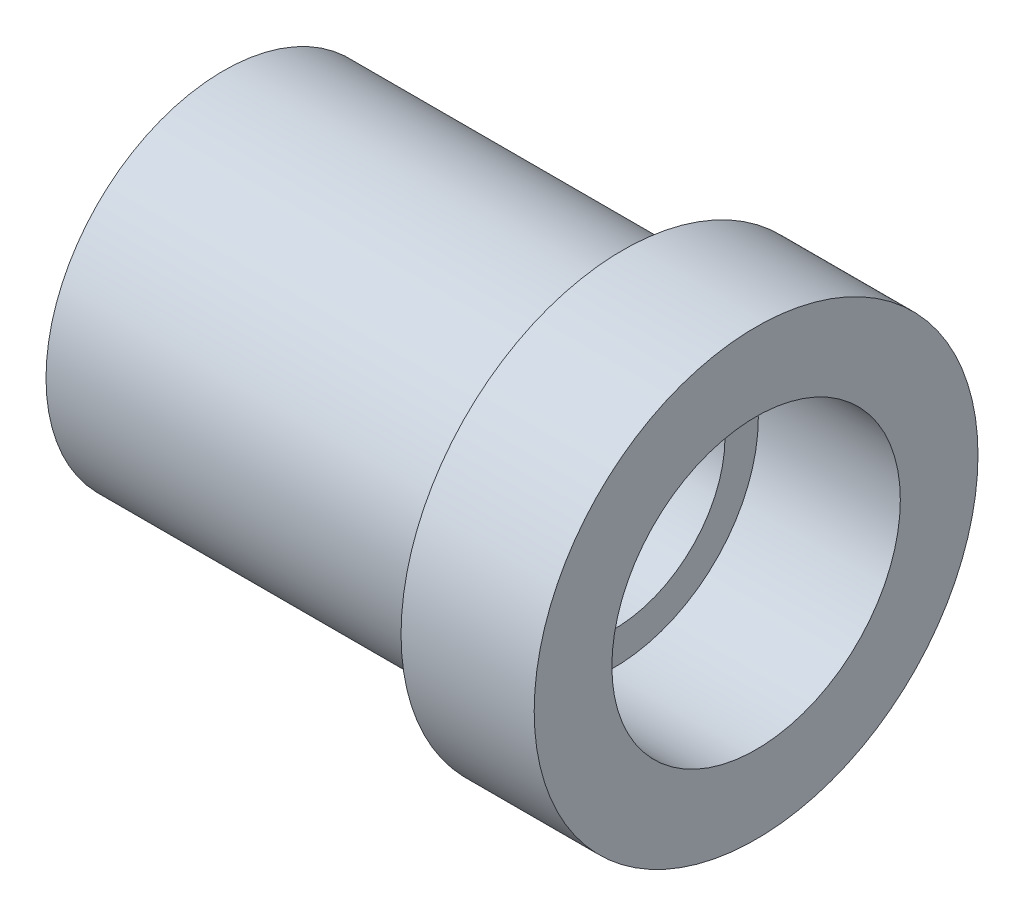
from build123d import *

# Parameters (mm, degrees)
TROU_TARAUD_M6X1_02_D   = 5
ESQUISSE7_R             = 3.25
ENL_V_MAT_EXTRU_1_DEPTH = 3.2


with BuildPart() as part:
    # Esquisse1 → R_volution1 (revolve)
    with BuildSketch(Plane.XY, mode=Mode.PRIVATE) as r_volution1_sk:
        Polygon((27.628248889, 4), (27.628248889, 5), (30.628248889, 5), (30.628248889, 1.733493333), (30.628248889, 0), (18.628248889, 0), (18.628248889, 4), align=None)
    revolve(r_volution1_sk.sketch.rotate(Axis((-32.762702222, 0, 0), (1, 0, 0)), 90), axis=Axis((-32.762702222, 0, 0), (1, 0, 0)))

    # Trou taraud_ M6x1.02 (through all)
    with Locations(Plane(origin=(30.628248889, 0, 0), x_dir=(0, 0, -1), z_dir=(1, 0, 0))):
        with Locations((0, 0)):
            Hole(TROU_TARAUD_M6X1_02_D / 2)

    # Esquisse7 → Enl_v. mat.-Extru.1 (cut)
    with BuildSketch(Plane(origin=(30.628248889, 0, 0), x_dir=(0, 0, -1), z_dir=(1, 0, 0))):
        Circle(ESQUISSE7_R)
    extrude(amount=-ENL_V_MAT_EXTRU_1_DEPTH, mode=Mode.SUBTRACT)


solid = part.part
